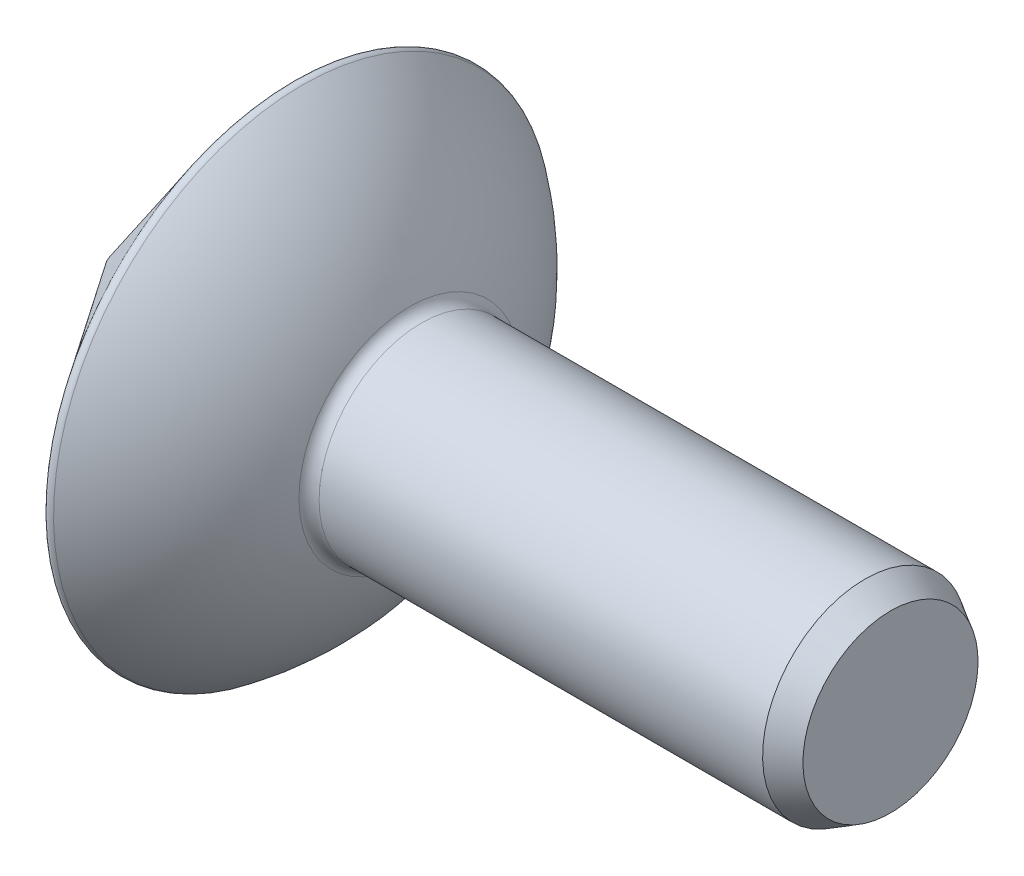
from build123d import *

# Parameters (mm, degrees)
CONG_1_R         = 0.25
CHANFREIN1_SIZE  = 1
CHANFREIN1_SIZE2 = 0.577350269
CONG_2_R         = 0.5


with BuildPart() as part:
    # Esquisse1 → R_volution1 (revolve)
    with BuildSketch(Plane.XY):
        with BuildLine():
            Line((-0.399317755, 0.300907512), (6.816190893, 9.876210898))
            ThreePointArc((6.816190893, 9.876210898), (9.529206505, 7.293437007), (11.313708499, 4))
            Line((11.313708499, 4), (30, 4))
            Line((30, 4), (30, 0))
            Line((30, 0), (-0.5, 0))
            ThreePointArc((-0.5, 0), (-0.474161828, 0.158652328), (-0.399317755, 0.300907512))
        make_face()
    revolve(axis=Axis((0, 0, 0), (-1, 0, 0)))

    # Cong_1
    cong_1_edges = [part.edges().sort_by_distance(p)[0] for p in [
        (6.816190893, -9.876210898, 0),
    ]]
    fillet(cong_1_edges, radius=CONG_1_R)

    # Chanfrein1
    chanfrein1_edges = [part.edges().sort_by_distance(p)[0] for p in [
        (30, -4, 0),
    ]]
    chanfrein1_side = [part.faces().sort_by_distance(p)[0] for p in [
        (20.656854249, -4, 0),
    ]]
    chamfer(chanfrein1_edges, length=CHANFREIN1_SIZE, length2=CHANFREIN1_SIZE2, reference=chanfrein1_side[0])

    # Cong_2
    cong_2_edges = [part.edges().sort_by_distance(p)[0] for p in [
        (11.313708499, -4, 0),
    ]]
    fillet(cong_2_edges, radius=CONG_2_R)


solid = part.part
